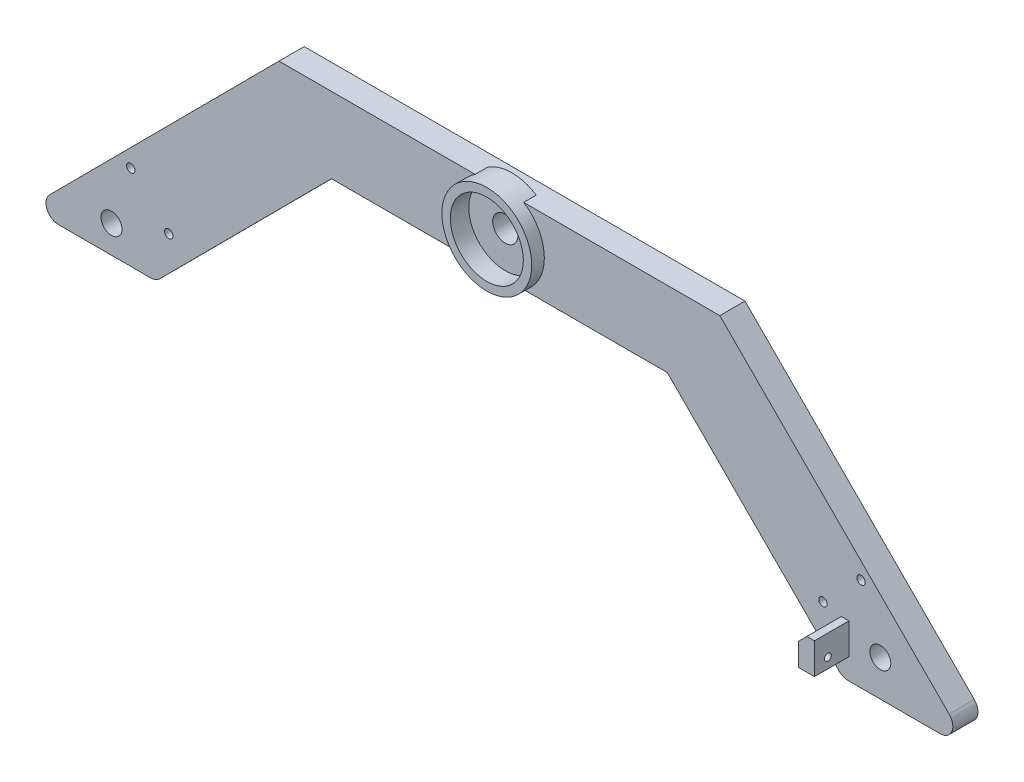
from build123d import *

# Parameters (mm, degrees)
BOSS_EXTRUDE1_DEPTH = 3.81
SKETCH2_R           = 3.175
CUT_EXTRUDE1_DEPTH  = 210.483232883
SKETCH3_R           = 13.589
BOSS_EXTRUDE2_DEPTH = 7.62
SKETCH4_R           = 3.81
CUT_EXTRUDE2_DEPTH  = 11.43
SKETCH5_R           = 11.049
CUT_EXTRUDE3_DEPTH  = 5.588
SKETCH8_W           = 4.826
SKETCH8_H           = 9.398
BOSS_EXTRUDE3_DEPTH = 10.414
CHAMFER1_SIZE       = 2.54
SKETCH9_R           = 1.0287
CUT_EXTRUDE4_DEPTH  = 256.099393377
FILLET1_R           = 0.508
SKETCH11_R          = 1.27
CUT_EXTRUDE5_DEPTH  = 10.16


with BuildPart() as part:
    # Sketch1 → Boss-Extrude1 (new, symmetric)
    with BuildSketch(Plane.XY):
        with BuildLine():
            Line((-78.422711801, -70.202411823), (-9.048093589, -0.500134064))
            Line((-9.048093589, -0.500134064), (124.303502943, -0.500134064))
            Line((124.303502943, -0.500134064), (193.678121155, -70.202411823))
            ThreePointArc((193.678121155, -70.202411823), (194.495965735, -74.352303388), (190.977704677, -76.700134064))
            Line((190.977704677, -76.700134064), (163.09108168, -76.700134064))
            ThreePointArc((163.09108168, -76.700134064), (161.628912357, -76.408395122), (160.390665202, -75.577856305))
            Line((160.390665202, -75.577856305), (108.427704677, -23.369472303))
            Line((108.427704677, -23.369472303), (6.827704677, -23.369472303))
            Line((6.827704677, -23.369472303), (-45.135255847, -75.577856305))
            ThreePointArc((-45.135255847, -75.577856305), (-46.373503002, -76.408395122), (-47.835672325, -76.700134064))
            Line((-47.835672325, -76.700134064), (-75.722295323, -76.700134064))
            ThreePointArc((-75.722295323, -76.700134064), (-79.24055638, -74.352303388), (-78.422711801, -70.202411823))
        make_face()
    extrude(amount=BOSS_EXTRUDE1_DEPTH, both=True)

    # Sketch2 → Cut-Extrude1 (cut, through all)
    with BuildSketch(Plane.XY.offset(3.81)):
        with Locations((-59.720295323, -68.318134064)):
            Circle(SKETCH2_R)
        with Locations((172.855760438, -65.778134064)):
            Circle(SKETCH2_R)
    extrude(amount=-CUT_EXTRUDE1_DEPTH, mode=Mode.SUBTRACT)

    # Sketch3 → Boss-Extrude2 (add)
    with BuildSketch(Plane.XY):
        with Locations(Location((57.627704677, -11.930134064, 0), (0, 0, 122.741263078))):
            Circle(SKETCH3_R)
    extrude(amount=BOSS_EXTRUDE2_DEPTH)

    # Sketch4 → Cut-Extrude2 (cut)
    with BuildSketch(Plane.XY.offset(7.62)):
        with Locations((57.627704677, -11.930134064)):
            Circle(SKETCH4_R)
    extrude(amount=-CUT_EXTRUDE2_DEPTH, mode=Mode.SUBTRACT)

    # Sketch5 → Cut-Extrude3 (cut)
    with BuildSketch(Plane.XY.offset(7.62)):
        with Locations((57.627704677, -11.930134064)):
            Circle(SKETCH5_R)
    extrude(amount=-CUT_EXTRUDE3_DEPTH, mode=Mode.SUBTRACT)

    # Sketch8 → Boss-Extrude3 (add)
    with BuildSketch(Plane.XY.offset(3.81)):
        with Locations((160.934238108, -65.651134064)):
            Rectangle(SKETCH8_W, SKETCH8_H)
    extrude(amount=BOSS_EXTRUDE3_DEPTH)

    # Chamfer1
    chamfer1_edges = [part.edges().sort_by_distance(p)[0] for p in [
        (158.521238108, -60.952134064, 9.017),
    ]]
    chamfer(chamfer1_edges, length=CHAMFER1_SIZE)

    # Sketch9 → Cut-Extrude4 (cut, through all)
    with BuildSketch(Plane(origin=(163.347238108, 0, 0), x_dir=(0, 0, -1), z_dir=(1, 0, 0))):
        with Locations((-10.165114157, -67.259916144)):
            Circle(SKETCH9_R)
    extrude(amount=-CUT_EXTRUDE4_DEPTH, mode=Mode.SUBTRACT)

    # Fillet1
    fillet1_edges = [part.edges().sort_by_distance(p)[0] for p in [
        (158.521238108, -67.259916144, 11.193814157),
    ]]
    fillet(fillet1_edges, radius=FILLET1_R)

    # Sketch11 → Cut-Extrude5 (cut)
    with BuildSketch(Plane(origin=(0, 0, -3.81), x_dir=(-1, 0, 0), z_dir=(0, 0, -1))):
        with Locations((42.38531398, -62.404755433)):
            Circle(SKETCH11_R)
        with Locations((53.888662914, -50.95548195)):
            Circle(SKETCH11_R)
        with Locations((-167.02412803, -48.41548195)):
            Circle(SKETCH11_R)
        with Locations((-155.520779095, -59.864755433)):
            Circle(SKETCH11_R)
    extrude(amount=-CUT_EXTRUDE5_DEPTH, mode=Mode.SUBTRACT)


solid = part.part
